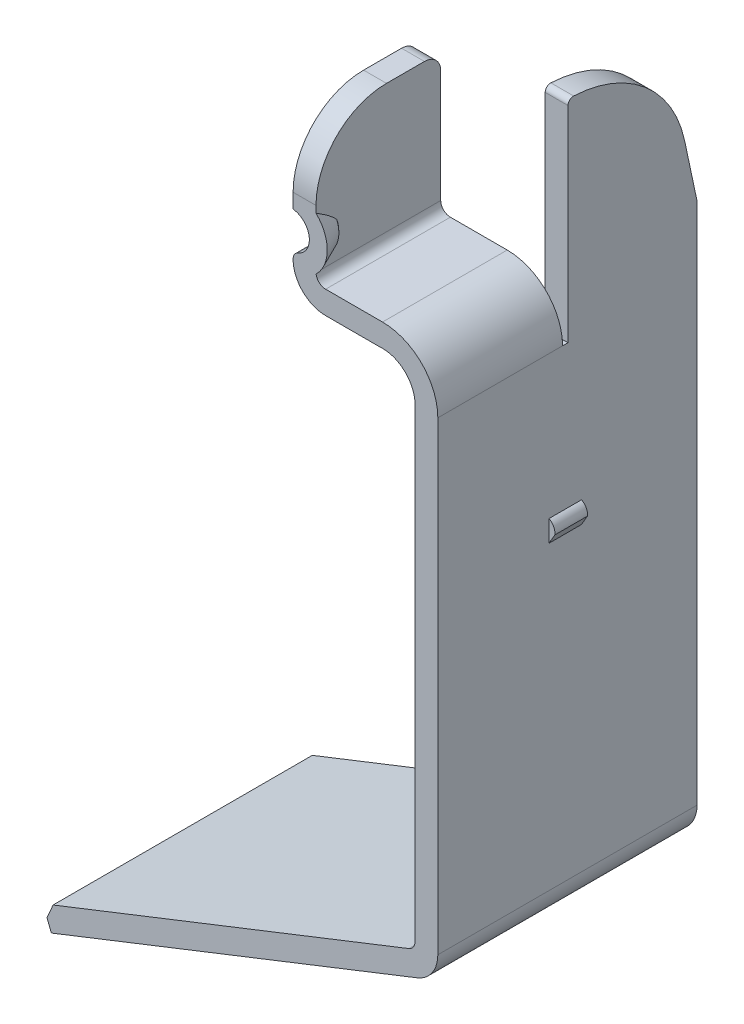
ISO-10303-21;
HEADER;
FILE_DESCRIPTION(('STEP AP214'),'2;1');
FILE_NAME('part.step','',(''),(''),'','','');
FILE_SCHEMA(('AUTOMOTIVE_DESIGN { 1 0 10303 214 1 1 1 1 }'));
ENDSEC;
DATA;
#1=APPLICATION_CONTEXT('core data for automotive mechanical design processes');
#2=APPLICATION_PROTOCOL_DEFINITION('international standard','automotive_design',2000,#1);
#3=PRODUCT_CONTEXT('',#1,'mechanical');
#4=PRODUCT('Part','Part','',(#3));
#5=PRODUCT_RELATED_PRODUCT_CATEGORY('part','',(#4));
#6=PRODUCT_DEFINITION_FORMATION('','',#4);
#7=PRODUCT_DEFINITION_CONTEXT('part definition',#1,'design');
#8=PRODUCT_DEFINITION('design','',#6,#7);
#9=PRODUCT_DEFINITION_SHAPE('','',#8);
#10=(LENGTH_UNIT() NAMED_UNIT(*) SI_UNIT(.MILLI.,.METRE.));
#11=(NAMED_UNIT(*) PLANE_ANGLE_UNIT() SI_UNIT($,.RADIAN.));
#12=(NAMED_UNIT(*) SI_UNIT($,.STERADIAN.) SOLID_ANGLE_UNIT());
#13=UNCERTAINTY_MEASURE_WITH_UNIT(LENGTH_MEASURE(1.E-05),#10,'distance_accuracy_value','');
#14=(GEOMETRIC_REPRESENTATION_CONTEXT(3) GLOBAL_UNCERTAINTY_ASSIGNED_CONTEXT((#13)) GLOBAL_UNIT_ASSIGNED_CONTEXT((#10,
#11,#12)) REPRESENTATION_CONTEXT('',''));
#15=CARTESIAN_POINT('',(0.,0.,0.));
#16=DIRECTION('',(0.,0.,1.));
#17=DIRECTION('',(1.,0.,0.));
#18=AXIS2_PLACEMENT_3D('',#15,#16,#17);
#19=CARTESIAN_POINT('',(12.3966122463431,32.9922720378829,-5.842));
#20=DIRECTION('',(1.,0.,0.));
#21=DIRECTION('',(0.,0.,-1.));
#22=AXIS2_PLACEMENT_3D('',#19,#20,#21);
#23=PLANE('',#22);
#24=CARTESIAN_POINT('',(12.3966122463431,34.6686720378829,-0.967492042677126));
#25=CARTESIAN_POINT('',(12.3966122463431,34.6984967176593,-0.940173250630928));
#26=CARTESIAN_POINT('',(12.3966122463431,34.7273615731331,-0.91185783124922));
#27=CARTESIAN_POINT('',(12.3966122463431,34.7834644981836,-0.853710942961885));
#28=CARTESIAN_POINT('',(12.3966122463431,34.8107042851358,-0.823881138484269));
#29=CARTESIAN_POINT('',(12.3966122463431,34.8638854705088,-0.763153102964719));
#30=CARTESIAN_POINT('',(12.3966122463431,34.889828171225,-0.732255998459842));
#31=CARTESIAN_POINT('',(12.3966122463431,34.940679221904,-0.669608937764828));
#32=CARTESIAN_POINT('',(12.3966122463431,34.9655872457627,-0.637858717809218));
#33=CARTESIAN_POINT('',(12.3966122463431,35.038999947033,-0.541677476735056));
#34=CARTESIAN_POINT('',(12.3966122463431,35.0862284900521,-0.476274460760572));
#35=CARTESIAN_POINT('',(12.3966122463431,35.1787869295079,-0.343091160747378));
#36=CARTESIAN_POINT('',(12.3966122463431,35.2240902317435,-0.275292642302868));
#37=CARTESIAN_POINT('',(12.3966122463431,35.2907056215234,-0.172687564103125));
#38=CARTESIAN_POINT('',(12.3966122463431,35.3126969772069,-0.138319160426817));
#39=CARTESIAN_POINT('',(12.3966122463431,35.3562798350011,-0.0693353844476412));
#40=CARTESIAN_POINT('',(12.3966122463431,35.3778713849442,-0.0347200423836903));
#41=CARTESIAN_POINT('',(12.3966122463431,35.3992927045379,0.));
#42=B_SPLINE_CURVE_WITH_KNOTS('',3,(#24,#25,#26,#27,#28,#29,#30,#31,#32,#33,#34,#35,#36,#37,#38,
#39,#40,#41),.UNSPECIFIED.,.F.,.F.,(4,2,2,2,2,2,2,2,4),(0.,0.121262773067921,0.24239503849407,
0.363403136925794,0.484449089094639,0.726378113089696,0.970967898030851,1.09337176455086,
1.21576089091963),.UNSPECIFIED.);
#43=CARTESIAN_POINT('',(12.3966122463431,34.6686720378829,-0.967492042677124));
#44=VERTEX_POINT('',#43);
#45=CARTESIAN_POINT('',(12.3966122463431,35.3992927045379,0.));
#46=VERTEX_POINT('',#45);
#47=EDGE_CURVE('E295',#44,#46,#42,.T.);
#48=ORIENTED_EDGE('',*,*,#47,.F.);
#49=CARTESIAN_POINT('',(12.3966122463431,34.6686720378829,-0.967492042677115));
#50=CARTESIAN_POINT('',(12.3966122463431,34.6333036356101,-0.980690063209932));
#51=CARTESIAN_POINT('',(12.3966122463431,34.5975342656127,-0.992897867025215));
#52=CARTESIAN_POINT('',(12.3966122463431,34.5251958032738,-1.01491583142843));
#53=CARTESIAN_POINT('',(12.3966122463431,34.4886253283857,-1.02472142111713));
#54=CARTESIAN_POINT('',(12.3966122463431,34.4160659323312,-1.04118215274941));
#55=CARTESIAN_POINT('',(12.3966122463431,34.3800990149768,-1.04793242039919));
#56=CARTESIAN_POINT('',(12.3966122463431,34.3077455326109,-1.0583970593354));
#57=CARTESIAN_POINT('',(12.3966122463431,34.2713592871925,-1.06211360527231));
#58=CARTESIAN_POINT('',(12.3966122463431,34.200643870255,-1.06616523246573));
#59=CARTESIAN_POINT('',(12.3966122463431,34.166325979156,-1.0666944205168));
#60=CARTESIAN_POINT('',(12.3966122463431,34.097772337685,-1.06486539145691));
#61=CARTESIAN_POINT('',(12.3966122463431,34.0635365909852,-1.06250704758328));
#62=CARTESIAN_POINT('',(12.3966122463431,33.9668938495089,-1.05188120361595));
#63=CARTESIAN_POINT('',(12.3966122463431,33.9048271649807,-1.04032431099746));
#64=CARTESIAN_POINT('',(12.3966122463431,33.8127387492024,-1.01717325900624));
#65=CARTESIAN_POINT('',(12.3966122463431,33.7819501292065,-1.00838515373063));
#66=CARTESIAN_POINT('',(12.3966122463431,33.7209374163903,-0.989130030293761));
#67=CARTESIAN_POINT('',(12.3966122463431,33.6907127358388,-0.978664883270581));
#68=CARTESIAN_POINT('',(12.3966122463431,33.6607502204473,-0.967492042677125));
#69=B_SPLINE_CURVE_WITH_KNOTS('',3,(#49,#50,#51,#52,#53,#54,#55,#56,#57,#58,#59,#60,#61,#62,#63,
#64,#65,#66,#67,#68),.UNSPECIFIED.,.F.,.F.,(4,2,2,2,2,2,2,2,2,4),(0.,0.113281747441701,
0.226777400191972,0.336444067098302,0.446032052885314,0.548872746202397,0.651717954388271,
0.840415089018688,0.93643527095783,1.03234905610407),.UNSPECIFIED.);
#70=CARTESIAN_POINT('',(12.3966122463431,33.6607502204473,-0.967492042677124));
#71=VERTEX_POINT('',#70);
#72=EDGE_CURVE('E347',#44,#71,#69,.T.);
#73=ORIENTED_EDGE('',*,*,#72,.T.);
#74=CARTESIAN_POINT('',(12.3966122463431,33.6607502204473,-0.967492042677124));
#75=CARTESIAN_POINT('',(12.3966122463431,33.6309255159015,-0.940173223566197));
#76=CARTESIAN_POINT('',(12.3966122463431,33.6020606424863,-0.911857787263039));
#77=CARTESIAN_POINT('',(12.3966122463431,33.5459577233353,-0.853710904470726));
#78=CARTESIAN_POINT('',(12.3966122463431,33.5187179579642,-0.823881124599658));
#79=CARTESIAN_POINT('',(12.3966122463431,33.4655367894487,-0.763153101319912));
#80=CARTESIAN_POINT('',(12.3966122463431,33.4395940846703,-0.732255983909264));
#81=CARTESIAN_POINT('',(12.3966122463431,33.3887430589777,-0.669608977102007));
#82=CARTESIAN_POINT('',(12.3966122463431,33.3638350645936,-0.637858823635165));
#83=CARTESIAN_POINT('',(12.3966122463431,33.2904222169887,-0.54167727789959));
#84=CARTESIAN_POINT('',(12.3966122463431,33.2431932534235,-0.476273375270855));
#85=CARTESIAN_POINT('',(12.3966122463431,33.1617935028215,-0.359147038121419));
#86=CARTESIAN_POINT('',(12.3966122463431,33.1271301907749,-0.307761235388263));
#87=CARTESIAN_POINT('',(12.3966122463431,33.0589251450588,-0.204210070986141));
#88=CARTESIAN_POINT('',(12.3966122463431,33.025384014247,-0.152044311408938));
#89=CARTESIAN_POINT('',(12.3966122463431,32.9922720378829,-0.0996119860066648));
#90=B_SPLINE_CURVE_WITH_KNOTS('',3,(#74,#75,#76,#77,#78,#79,#80,#81,#82,#83,#84,#85,#86,#87,#88,
#89),.UNSPECIFIED.,.F.,.F.,(4,2,2,2,2,2,2,4),(0.,0.121262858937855,0.242395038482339,
0.363403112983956,0.484449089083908,0.726378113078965,0.912318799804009,1.09835782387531),.UNSPECIFIED.);
#91=CARTESIAN_POINT('',(12.3966122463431,32.9922720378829,-0.0996119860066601));
#92=VERTEX_POINT('',#91);
#93=EDGE_CURVE('E326',#71,#92,#90,.T.);
#94=ORIENTED_EDGE('',*,*,#93,.T.);
#95=DIRECTION('',(0.,0.,1.));
#96=VECTOR('',#95,1.);
#97=CARTESIAN_POINT('',(12.3966122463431,32.9922720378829,-5.842));
#98=LINE('',#97,#96);
#99=CARTESIAN_POINT('',(12.3966122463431,32.9922720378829,-5.842));
#100=VERTEX_POINT('',#99);
#101=EDGE_CURVE('E480',#100,#92,#98,.T.);
#102=ORIENTED_EDGE('',*,*,#101,.F.);
#103=DIRECTION('',(0.,1.,0.));
#104=VECTOR('',#103,1.);
#105=CARTESIAN_POINT('',(12.3966122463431,32.9922720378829,-5.842));
#106=LINE('',#105,#104);
#107=CARTESIAN_POINT('',(12.3966122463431,38.2524,-5.842));
#108=VERTEX_POINT('',#107);
#109=EDGE_CURVE('E522',#100,#108,#106,.T.);
#110=ORIENTED_EDGE('',*,*,#109,.T.);
#111=CARTESIAN_POINT('',(12.3966122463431,38.2524,-5.08));
#112=DIRECTION('',(1.,0.,0.));
#113=DIRECTION('',(0.,0.,-1.));
#114=AXIS2_PLACEMENT_3D('',#111,#112,#113);
#115=CIRCLE('',#114,0.762);
#116=CARTESIAN_POINT('',(12.3966122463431,39.0144,-5.08));
#117=VERTEX_POINT('',#116);
#118=EDGE_CURVE('E362',#108,#117,#115,.T.);
#119=ORIENTED_EDGE('',*,*,#118,.T.);
#120=DIRECTION('',(0.,0.,-1.));
#121=VECTOR('',#120,1.);
#122=CARTESIAN_POINT('',(12.3966122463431,39.0144,-5.842));
#123=LINE('',#122,#121);
#124=CARTESIAN_POINT('',(12.3966122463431,39.0144,-3.302));
#125=VERTEX_POINT('',#124);
#126=EDGE_CURVE('E541',#125,#117,#123,.T.);
#127=ORIENTED_EDGE('',*,*,#126,.F.);
#128=CARTESIAN_POINT('',(12.3966122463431,35.7124,-3.302));
#129=DIRECTION('',(1.,0.,0.));
#130=DIRECTION('',(0.,0.,-1.));
#131=AXIS2_PLACEMENT_3D('',#128,#129,#130);
#132=CIRCLE('',#131,3.302);
#133=CARTESIAN_POINT('',(12.3966122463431,35.7124,0.));
#134=VERTEX_POINT('',#133);
#135=EDGE_CURVE('E367',#134,#125,#132,.F.);
#136=ORIENTED_EDGE('',*,*,#135,.F.);
#137=DIRECTION('',(0.,1.,0.));
#138=VECTOR('',#137,1.);
#139=CARTESIAN_POINT('',(12.3966122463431,32.9922720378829,0.));
#140=LINE('',#139,#138);
#141=EDGE_CURVE('E500',#46,#134,#140,.T.);
#142=ORIENTED_EDGE('',*,*,#141,.F.);
#143=EDGE_LOOP('',(#48,#73,#94,#102,#110,#119,#127,#136,#142));
#144=FACE_BOUND('',#143,.T.);
#145=ADVANCED_FACE('F32',(#144),#23,.T.);
#146=CARTESIAN_POINT('',(12.8477611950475,32.9922720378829,-5.842));
#147=DIRECTION('',(0.,0.,1.));
#148=DIRECTION('',(1.,0.,0.));
#149=AXIS2_PLACEMENT_3D('',#146,#147,#148);
#150=CYLINDRICAL_SURFACE('',#149,0.451148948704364);
#151=ORIENTED_EDGE('',*,*,#101,.T.);
#152=CARTESIAN_POINT('',(12.3966122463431,32.9922720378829,-0.0996119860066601));
#153=CARTESIAN_POINT('',(12.3966126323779,32.9871289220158,-0.0914621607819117));
#154=CARTESIAN_POINT('',(12.3967001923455,32.9820596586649,-0.0832663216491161));
#155=CARTESIAN_POINT('',(12.3970373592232,32.9720607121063,-0.0667984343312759));
#156=CARTESIAN_POINT('',(12.3972868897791,32.9671309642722,-0.0585264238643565));
#157=CARTESIAN_POINT('',(12.3979357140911,32.9573981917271,-0.0419144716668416));
#158=CARTESIAN_POINT('',(12.398335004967,32.9525951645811,-0.033574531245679));
#159=CARTESIAN_POINT('',(12.3992740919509,32.9431051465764,-0.0168314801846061));
#160=CARTESIAN_POINT('',(12.3998139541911,32.9384182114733,-0.0084283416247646));
#161=CARTESIAN_POINT('',(12.4004192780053,32.9337862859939,0.));
#162=B_SPLINE_CURVE_WITH_KNOTS('',3,(#152,#153,#154,#155,#156,#157,#158,#159,#160,#161),
.UNSPECIFIED.,.F.,.F.,(4,2,2,2,4),(0.,0.0289094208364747,0.057805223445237,0.0867004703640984,
0.115609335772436),.UNSPECIFIED.);
#163=CARTESIAN_POINT('',(12.4004192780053,32.9337862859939,0.));
#164=VERTEX_POINT('',#163);
#165=EDGE_CURVE('E353',#92,#164,#162,.T.);
#166=ORIENTED_EDGE('',*,*,#165,.T.);
#167=CARTESIAN_POINT('',(12.8477611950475,32.9922720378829,0.));
#168=DIRECTION('',(0.,0.,-1.));
#169=DIRECTION('',(-1.,0.,0.));
#170=AXIS2_PLACEMENT_3D('',#167,#168,#169);
#171=CIRCLE('',#170,0.451148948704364);
#172=CARTESIAN_POINT('',(12.8477611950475,32.5411230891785,0.));
#173=VERTEX_POINT('',#172);
#174=EDGE_CURVE('E502',#173,#164,#171,.T.);
#175=ORIENTED_EDGE('',*,*,#174,.F.);
#176=DIRECTION('',(0.,0.,1.));
#177=VECTOR('',#176,1.);
#178=CARTESIAN_POINT('',(12.8477611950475,32.5411230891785,-5.842));
#179=LINE('',#178,#177);
#180=CARTESIAN_POINT('',(12.8477611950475,32.5411230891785,-5.842));
#181=VERTEX_POINT('',#180);
#182=EDGE_CURVE('E478',#181,#173,#179,.T.);
#183=ORIENTED_EDGE('',*,*,#182,.F.);
#184=CARTESIAN_POINT('',(12.8477611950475,32.9922720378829,-5.842));
#185=DIRECTION('',(0.,0.,-1.));
#186=DIRECTION('',(-1.,0.,0.));
#187=AXIS2_PLACEMENT_3D('',#184,#185,#186);
#188=CIRCLE('',#187,0.451148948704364);
#189=EDGE_CURVE('E525',#181,#100,#188,.T.);
#190=ORIENTED_EDGE('',*,*,#189,.T.);
#191=EDGE_LOOP('',(#151,#166,#175,#183,#190));
#192=FACE_BOUND('',#191,.T.);
#193=ADVANCED_FACE('F339',(#192),#150,.F.);
#194=CARTESIAN_POINT('',(17.0357763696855,8.16844913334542,0.));
#195=DIRECTION('',(-1.,0.,0.));
#196=DIRECTION('',(0.,-1.,0.));
#197=AXIS2_PLACEMENT_3D('',#194,#195,#196);
#198=PLANE('',#197);
#199=DIRECTION('',(0.,1.,0.));
#200=VECTOR('',#199,1.);
#201=CARTESIAN_POINT('',(17.0357763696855,8.16844913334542,-6.096));
#202=LINE('',#201,#200);
#203=CARTESIAN_POINT('',(17.0357763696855,29.9503230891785,-6.096));
#204=VERTEX_POINT('',#203);
#205=CARTESIAN_POINT('',(17.0357763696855,39.5708720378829,-6.096));
#206=VERTEX_POINT('',#205);
#207=EDGE_CURVE('E458',#204,#206,#202,.T.);
#208=ORIENTED_EDGE('',*,*,#207,.T.);
#209=CARTESIAN_POINT('',(17.0357763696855,39.5708720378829,-6.35));
#210=DIRECTION('',(-1.,0.,0.));
#211=DIRECTION('',(0.,-1.,0.));
#212=AXIS2_PLACEMENT_3D('',#209,#210,#211);
#213=CIRCLE('',#212,0.254);
#214=CARTESIAN_POINT('',(17.0357763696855,39.8245838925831,-6.36209523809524));
#215=VERTEX_POINT('',#214);
#216=EDGE_CURVE('E382',#206,#215,#213,.T.);
#217=ORIENTED_EDGE('',*,*,#216,.T.);
#218=CARTESIAN_POINT('',(17.0357763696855,34.2429230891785,-6.096));
#219=DIRECTION('',(-1.,0.,0.));
#220=DIRECTION('',(0.,-1.,0.));
#221=AXIS2_PLACEMENT_3D('',#218,#219,#220);
#222=CIRCLE('',#221,5.588);
#223=CARTESIAN_POINT('',(17.0357763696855,35.4047336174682,-11.5618887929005));
#224=VERTEX_POINT('',#223);
#225=EDGE_CURVE('E442',#224,#215,#222,.F.);
#226=ORIENTED_EDGE('',*,*,#225,.F.);
#227=DIRECTION('',(0.,0.978147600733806,0.207911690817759));
#228=VECTOR('',#227,1.);
#229=CARTESIAN_POINT('',(17.0357763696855,11.6971213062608,-16.6010973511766));
#230=LINE('',#229,#228);
#231=CARTESIAN_POINT('',(17.0357763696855,32.6792886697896,-12.1412));
#232=VERTEX_POINT('',#231);
#233=EDGE_CURVE('E436',#232,#224,#230,.T.);
#234=ORIENTED_EDGE('',*,*,#233,.F.);
#235=DIRECTION('',(0.,1.,0.));
#236=VECTOR('',#235,1.);
#237=CARTESIAN_POINT('',(17.0357763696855,8.16844913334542,-12.1412));
#238=LINE('',#237,#236);
#239=CARTESIAN_POINT('',(17.0357763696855,8.16844913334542,-12.1412));
#240=VERTEX_POINT('',#239);
#241=EDGE_CURVE('E392',#240,#232,#238,.T.);
#242=ORIENTED_EDGE('',*,*,#241,.F.);
#243=DIRECTION('',(0.,0.,1.));
#244=VECTOR('',#243,1.);
#245=CARTESIAN_POINT('',(17.0357763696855,8.16844913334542,0.));
#246=LINE('',#245,#244);
#247=CARTESIAN_POINT('',(17.0357763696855,8.16844913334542,0.));
#248=VERTEX_POINT('',#247);
#249=EDGE_CURVE('E412',#240,#248,#246,.T.);
#250=ORIENTED_EDGE('',*,*,#249,.T.);
#251=DIRECTION('',(0.,1.,0.));
#252=VECTOR('',#251,1.);
#253=CARTESIAN_POINT('',(17.0357763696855,8.16844913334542,0.));
#254=LINE('',#253,#252);
#255=CARTESIAN_POINT('',(17.0357763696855,29.9503230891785,0.));
#256=VERTEX_POINT('',#255);
#257=EDGE_CURVE('E395',#248,#256,#254,.T.);
#258=ORIENTED_EDGE('',*,*,#257,.T.);
#259=DIRECTION('',(0.,0.,1.));
#260=VECTOR('',#259,1.);
#261=CARTESIAN_POINT('',(17.0357763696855,29.9503230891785,-5.842));
#262=LINE('',#261,#260);
#263=CARTESIAN_POINT('',(17.0357763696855,29.9503230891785,-5.842));
#264=VERTEX_POINT('',#263);
#265=EDGE_CURVE('E472',#264,#256,#262,.T.);
#266=ORIENTED_EDGE('',*,*,#265,.F.);
#267=DIRECTION('',(0.,0.,1.));
#268=VECTOR('',#267,1.);
#269=CARTESIAN_POINT('',(17.0357763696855,29.9503230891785,0.));
#270=LINE('',#269,#268);
#271=EDGE_CURVE('E455',#204,#264,#270,.T.);
#272=ORIENTED_EDGE('',*,*,#271,.F.);
#273=EDGE_LOOP('',(#208,#217,#226,#234,#242,#250,#258,#266,#272));
#274=FACE_BOUND('',#273,.T.);
#275=DIRECTION('',(0.,0.,1.));
#276=VECTOR('',#275,1.);
#277=CARTESIAN_POINT('',(17.0357763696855,22.2592097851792,-7.493));
#278=LINE('',#277,#276);
#279=CARTESIAN_POINT('',(17.0357763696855,22.2592097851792,-7.493));
#280=VERTEX_POINT('',#279);
#281=CARTESIAN_POINT('',(17.0357763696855,22.2592097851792,-5.969));
#282=VERTEX_POINT('',#281);
#283=EDGE_CURVE('E567',#280,#282,#278,.T.);
#284=ORIENTED_EDGE('',*,*,#283,.F.);
#285=DIRECTION('',(0.,-1.,0.));
#286=VECTOR('',#285,1.);
#287=CARTESIAN_POINT('',(17.0357763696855,21.3134430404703,-7.493));
#288=LINE('',#287,#286);
#289=CARTESIAN_POINT('',(17.0357763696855,23.2602423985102,-7.493));
#290=VERTEX_POINT('',#289);
#291=EDGE_CURVE('E576',#290,#280,#288,.T.);
#292=ORIENTED_EDGE('',*,*,#291,.F.);
#293=DIRECTION('',(0.,0.,1.));
#294=VECTOR('',#293,1.);
#295=CARTESIAN_POINT('',(17.0357763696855,23.2602423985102,-7.493));
#296=LINE('',#295,#294);
#297=CARTESIAN_POINT('',(17.0357763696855,23.2602423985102,-5.969));
#298=VERTEX_POINT('',#297);
#299=EDGE_CURVE('E575',#290,#298,#296,.T.);
#300=ORIENTED_EDGE('',*,*,#299,.T.);
#301=DIRECTION('',(0.,-1.,0.));
#302=VECTOR('',#301,1.);
#303=CARTESIAN_POINT('',(17.0357763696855,21.3134430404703,-5.969));
#304=LINE('',#303,#302);
#305=EDGE_CURVE('E581',#298,#282,#304,.T.);
#306=ORIENTED_EDGE('',*,*,#305,.T.);
#307=EDGE_LOOP('',(#284,#292,#300,#306));
#308=FACE_BOUND('',#307,.T.);
#309=ADVANCED_FACE('F604',(#274,#308),#198,.T.);
#310=CARTESIAN_POINT('',(15.5625763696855,29.9503230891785,-32.588188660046));
#311=DIRECTION('',(0.,-1.,0.));
#312=DIRECTION('',(1.,0.,0.));
#313=AXIS2_PLACEMENT_3D('',#310,#311,#312);
#314=PLANE('',#313);
#315=DIRECTION('',(1.,0.,0.));
#316=VECTOR('',#315,1.);
#317=CARTESIAN_POINT('',(17.0357763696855,29.9503230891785,-5.842));
#318=LINE('',#317,#316);
#319=CARTESIAN_POINT('',(18.1025763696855,29.9503230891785,-5.842));
#320=VERTEX_POINT('',#319);
#321=EDGE_CURVE('E534',#264,#320,#318,.T.);
#322=ORIENTED_EDGE('',*,*,#321,.T.);
#323=DIRECTION('',(0.,0.,-1.));
#324=VECTOR('',#323,1.);
#325=CARTESIAN_POINT('',(18.1025763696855,29.9503230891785,-32.588188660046));
#326=LINE('',#325,#324);
#327=CARTESIAN_POINT('',(18.1025763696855,29.9503230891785,-6.096));
#328=VERTEX_POINT('',#327);
#329=EDGE_CURVE('E469',#320,#328,#326,.T.);
#330=ORIENTED_EDGE('',*,*,#329,.T.);
#331=DIRECTION('',(1.,0.,0.));
#332=VECTOR('',#331,1.);
#333=CARTESIAN_POINT('',(15.5625763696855,29.9503230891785,-6.096));
#334=LINE('',#333,#332);
#335=EDGE_CURVE('E465',#204,#328,#334,.T.);
#336=ORIENTED_EDGE('',*,*,#335,.F.);
#337=ORIENTED_EDGE('',*,*,#271,.T.);
#338=EDGE_LOOP('',(#322,#330,#336,#337));
#339=FACE_BOUND('',#338,.T.);
#340=ADVANCED_FACE('F734',(#339),#314,.F.);
#341=CARTESIAN_POINT('',(18.1025763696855,8.16844913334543,0.));
#342=DIRECTION('',(1.,0.,0.));
#343=DIRECTION('',(0.,1.,0.));
#344=AXIS2_PLACEMENT_3D('',#341,#342,#343);
#345=PLANE('',#344);
#346=DIRECTION('',(0.,-1.,0.));
#347=VECTOR('',#346,1.);
#348=CARTESIAN_POINT('',(18.1025763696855,23.2602423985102,-5.207));
#349=LINE('',#348,#347);
#350=CARTESIAN_POINT('',(18.1025763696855,23.2602423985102,-5.207));
#351=VERTEX_POINT('',#350);
#352=CARTESIAN_POINT('',(18.1025763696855,22.2592097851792,-5.207));
#353=VERTEX_POINT('',#352);
#354=EDGE_CURVE('E561',#351,#353,#349,.T.);
#355=ORIENTED_EDGE('',*,*,#354,.F.);
#356=DIRECTION('',(0.,0.,-1.));
#357=VECTOR('',#356,1.);
#358=CARTESIAN_POINT('',(18.1025763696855,23.2602423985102,-5.207));
#359=LINE('',#358,#357);
#360=CARTESIAN_POINT('',(18.1025763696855,23.2602423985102,-6.731));
#361=VERTEX_POINT('',#360);
#362=EDGE_CURVE('E555',#351,#361,#359,.T.);
#363=ORIENTED_EDGE('',*,*,#362,.T.);
#364=DIRECTION('',(0.,-1.,0.));
#365=VECTOR('',#364,1.);
#366=CARTESIAN_POINT('',(18.1025763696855,23.2602423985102,-6.731));
#367=LINE('',#366,#365);
#368=CARTESIAN_POINT('',(18.1025763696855,22.2592097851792,-6.731));
#369=VERTEX_POINT('',#368);
#370=EDGE_CURVE('E564',#361,#369,#367,.T.);
#371=ORIENTED_EDGE('',*,*,#370,.T.);
#372=DIRECTION('',(0.,0.,-1.));
#373=VECTOR('',#372,1.);
#374=CARTESIAN_POINT('',(18.1025763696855,22.2592097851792,-5.207));
#375=LINE('',#374,#373);
#376=EDGE_CURVE('E548',#353,#369,#375,.T.);
#377=ORIENTED_EDGE('',*,*,#376,.F.);
#378=EDGE_LOOP('',(#355,#363,#371,#377));
#379=FACE_BOUND('',#378,.T.);
#380=CARTESIAN_POINT('',(18.1025763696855,34.2429230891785,-6.096));
#381=DIRECTION('',(1.,0.,0.));
#382=DIRECTION('',(0.,1.,0.));
#383=AXIS2_PLACEMENT_3D('',#380,#381,#382);
#384=CIRCLE('',#383,5.588);
#385=CARTESIAN_POINT('',(18.1025763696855,39.8245838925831,-6.36209523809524));
#386=VERTEX_POINT('',#385);
#387=CARTESIAN_POINT('',(18.1025763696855,35.4047336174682,-11.5618887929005));
#388=VERTEX_POINT('',#387);
#389=EDGE_CURVE('E453',#386,#388,#384,.F.);
#390=ORIENTED_EDGE('',*,*,#389,.F.);
#391=CARTESIAN_POINT('',(18.1025763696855,39.5708720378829,-6.35));
#392=DIRECTION('',(1.,0.,0.));
#393=DIRECTION('',(0.,1.,0.));
#394=AXIS2_PLACEMENT_3D('',#391,#392,#393);
#395=CIRCLE('',#394,0.254);
#396=CARTESIAN_POINT('',(18.1025763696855,39.5708720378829,-6.096));
#397=VERTEX_POINT('',#396);
#398=EDGE_CURVE('E378',#386,#397,#395,.T.);
#399=ORIENTED_EDGE('',*,*,#398,.T.);
#400=DIRECTION('',(0.,-1.,0.));
#401=VECTOR('',#400,1.);
#402=CARTESIAN_POINT('',(18.1025763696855,23.999686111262,-6.096));
#403=LINE('',#402,#401);
#404=EDGE_CURVE('E462',#397,#328,#403,.T.);
#405=ORIENTED_EDGE('',*,*,#404,.T.);
#406=ORIENTED_EDGE('',*,*,#329,.F.);
#407=CARTESIAN_POINT('',(18.1025763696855,29.9503230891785,0.));
#408=VERTEX_POINT('',#407);
#409=EDGE_CURVE('E461',#408,#320,#326,.T.);
#410=ORIENTED_EDGE('',*,*,#409,.F.);
#411=DIRECTION('',(0.,1.,0.));
#412=VECTOR('',#411,1.);
#413=CARTESIAN_POINT('',(18.1025763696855,8.16844913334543,0.));
#414=LINE('',#413,#412);
#415=CARTESIAN_POINT('',(18.1025763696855,8.16844913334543,0.));
#416=VERTEX_POINT('',#415);
#417=EDGE_CURVE('E387',#416,#408,#414,.T.);
#418=ORIENTED_EDGE('',*,*,#417,.F.);
#419=DIRECTION('',(0.,0.,-1.));
#420=VECTOR('',#419,1.);
#421=CARTESIAN_POINT('',(18.1025763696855,8.16844913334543,0.));
#422=LINE('',#421,#420);
#423=CARTESIAN_POINT('',(18.1025763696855,8.16844913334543,-12.1412));
#424=VERTEX_POINT('',#423);
#425=EDGE_CURVE('E409',#416,#424,#422,.T.);
#426=ORIENTED_EDGE('',*,*,#425,.T.);
#427=DIRECTION('',(0.,1.,0.));
#428=VECTOR('',#427,1.);
#429=CARTESIAN_POINT('',(18.1025763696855,8.16844913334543,-12.1412));
#430=LINE('',#429,#428);
#431=CARTESIAN_POINT('',(18.1025763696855,32.6792886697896,-12.1412));
#432=VERTEX_POINT('',#431);
#433=EDGE_CURVE('E389',#424,#432,#430,.T.);
#434=ORIENTED_EDGE('',*,*,#433,.T.);
#435=DIRECTION('',(0.,-0.978147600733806,-0.207911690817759));
#436=VECTOR('',#435,1.);
#437=CARTESIAN_POINT('',(18.1025763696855,20.2166118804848,-14.7902237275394));
#438=LINE('',#437,#436);
#439=EDGE_CURVE('E449',#388,#432,#438,.T.);
#440=ORIENTED_EDGE('',*,*,#439,.F.);
#441=EDGE_LOOP('',(#390,#399,#405,#406,#410,#418,#426,#434,#440));
#442=FACE_BOUND('',#441,.T.);
#443=ADVANCED_FACE('F703',(#379,#442),#345,.T.);
#444=CARTESIAN_POINT('',(16.5785763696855,8.16844913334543,0.));
#445=DIRECTION('',(0.,0.,1.));
#446=DIRECTION('',(1.,0.,0.));
#447=AXIS2_PLACEMENT_3D('',#444,#445,#446);
#448=CYLINDRICAL_SURFACE('',#447,1.524);
#449=DIRECTION('',(0.,0.,-1.));
#450=VECTOR('',#449,1.);
#451=CARTESIAN_POINT('',(17.1371242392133,6.75049275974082,0.));
#452=LINE('',#451,#450);
#453=CARTESIAN_POINT('',(17.1371242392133,6.75049275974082,0.));
#454=VERTEX_POINT('',#453);
#455=CARTESIAN_POINT('',(17.1371242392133,6.75049275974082,-12.1412));
#456=VERTEX_POINT('',#455);
#457=EDGE_CURVE('E431',#454,#456,#452,.T.);
#458=ORIENTED_EDGE('',*,*,#457,.T.);
#459=CARTESIAN_POINT('',(16.5785763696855,8.16844913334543,-12.1412));
#460=DIRECTION('',(0.,0.,1.));
#461=DIRECTION('',(1.,0.,0.));
#462=AXIS2_PLACEMENT_3D('',#459,#460,#461);
#463=CIRCLE('',#462,1.524);
#464=EDGE_CURVE('E400',#456,#424,#463,.T.);
#465=ORIENTED_EDGE('',*,*,#464,.T.);
#466=ORIENTED_EDGE('',*,*,#425,.F.);
#467=CARTESIAN_POINT('',(16.5785763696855,8.16844913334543,0.));
#468=DIRECTION('',(0.,0.,1.));
#469=DIRECTION('',(1.,0.,0.));
#470=AXIS2_PLACEMENT_3D('',#467,#468,#469);
#471=CIRCLE('',#470,1.524);
#472=EDGE_CURVE('E397',#454,#416,#471,.T.);
#473=ORIENTED_EDGE('',*,*,#472,.F.);
#474=EDGE_LOOP('',(#458,#465,#466,#473));
#475=FACE_BOUND('',#474,.T.);
#476=ADVANCED_FACE('F700',(#475),#448,.T.);
#477=CARTESIAN_POINT('',(16.5785763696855,8.16844913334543,0.));
#478=DIRECTION('',(0.,0.,1.));
#479=DIRECTION('',(1.,0.,0.));
#480=AXIS2_PLACEMENT_3D('',#477,#478,#479);
#481=CYLINDRICAL_SURFACE('',#480,0.457199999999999);
#482=DIRECTION('',(0.,0.,1.));
#483=VECTOR('',#482,1.);
#484=CARTESIAN_POINT('',(16.7461407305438,7.74306222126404,0.));
#485=LINE('',#484,#483);
#486=CARTESIAN_POINT('',(16.7461407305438,7.74306222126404,-12.1412));
#487=VERTEX_POINT('',#486);
#488=CARTESIAN_POINT('',(16.7461407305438,7.74306222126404,0.));
#489=VERTEX_POINT('',#488);
#490=EDGE_CURVE('E427',#487,#489,#485,.T.);
#491=ORIENTED_EDGE('',*,*,#490,.T.);
#492=CARTESIAN_POINT('',(16.5785763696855,8.16844913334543,0.));
#493=DIRECTION('',(0.,0.,1.));
#494=DIRECTION('',(1.,0.,0.));
#495=AXIS2_PLACEMENT_3D('',#492,#493,#494);
#496=CIRCLE('',#495,0.457199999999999);
#497=EDGE_CURVE('E406',#489,#248,#496,.T.);
#498=ORIENTED_EDGE('',*,*,#497,.T.);
#499=ORIENTED_EDGE('',*,*,#249,.F.);
#500=CARTESIAN_POINT('',(16.5785763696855,8.16844913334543,-12.1412));
#501=DIRECTION('',(0.,0.,1.));
#502=DIRECTION('',(1.,0.,0.));
#503=AXIS2_PLACEMENT_3D('',#500,#501,#502);
#504=CIRCLE('',#503,0.457199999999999);
#505=EDGE_CURVE('E403',#487,#240,#504,.T.);
#506=ORIENTED_EDGE('',*,*,#505,.F.);
#507=EDGE_LOOP('',(#491,#498,#499,#506));
#508=FACE_BOUND('',#507,.T.);
#509=ADVANCED_FACE('F674',(#508),#481,.F.);
#510=CARTESIAN_POINT('',(17.1371242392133,6.75049275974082,0.));
#511=DIRECTION('',(0.,0.,-1.));
#512=DIRECTION('',(-1.,0.,0.));
#513=AXIS2_PLACEMENT_3D('',#510,#511,#512);
#514=PLANE('',#513);
#515=CARTESIAN_POINT('',(11.7126591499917,33.0077670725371,0.));
#516=DIRECTION('',(0.,0.,-1.));
#517=DIRECTION('',(1.,0.,0.));
#518=AXIS2_PLACEMENT_3D('',#515,#516,#517);
#519=CIRCLE('',#518,0.388792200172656);
#520=CARTESIAN_POINT('',(11.3239031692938,33.0130738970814,0.));
#521=VERTEX_POINT('',#520);
#522=CARTESIAN_POINT('',(11.5588821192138,33.3648552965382,0.));
#523=VERTEX_POINT('',#522);
#524=EDGE_CURVE('E271',#521,#523,#519,.T.);
#525=ORIENTED_EDGE('',*,*,#524,.F.);
#526=DIRECTION('',(0.0880242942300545,0.996118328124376,0.));
#527=VECTOR('',#526,1.);
#528=CARTESIAN_POINT('',(11.2834928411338,32.5557743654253,0.));
#529=LINE('',#528,#527);
#530=CARTESIAN_POINT('',(11.3237611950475,33.0114672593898,0.));
#531=VERTEX_POINT('',#530);
#532=EDGE_CURVE('E285',#531,#521,#529,.T.);
#533=ORIENTED_EDGE('',*,*,#532,.F.);
#534=DIRECTION('',(0.,-1.,0.));
#535=VECTOR('',#534,1.);
#536=CARTESIAN_POINT('',(11.3237611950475,32.9922720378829,0.));
#537=LINE('',#536,#535);
#538=CARTESIAN_POINT('',(11.3237611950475,32.9922720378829,0.));
#539=VERTEX_POINT('',#538);
#540=EDGE_CURVE('E499',#531,#539,#537,.T.);
#541=ORIENTED_EDGE('',*,*,#540,.T.);
#542=CARTESIAN_POINT('',(12.8477611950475,32.9922720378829,0.));
#543=DIRECTION('',(0.,0.,1.));
#544=DIRECTION('',(-1.,0.,0.));
#545=AXIS2_PLACEMENT_3D('',#542,#543,#544);
#546=CIRCLE('',#545,1.524);
#547=CARTESIAN_POINT('',(12.8477611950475,31.4682720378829,0.));
#548=VERTEX_POINT('',#547);
#549=EDGE_CURVE('E493',#539,#548,#546,.T.);
#550=ORIENTED_EDGE('',*,*,#549,.T.);
#551=DIRECTION('',(1.,0.,0.));
#552=VECTOR('',#551,1.);
#553=CARTESIAN_POINT('',(15.3761040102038,31.4682720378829,0.));
#554=LINE('',#553,#552);
#555=CARTESIAN_POINT('',(15.3761040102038,31.4682720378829,0.));
#556=VERTEX_POINT('',#555);
#557=EDGE_CURVE('E489',#548,#556,#554,.T.);
#558=ORIENTED_EDGE('',*,*,#557,.T.);
#559=CARTESIAN_POINT('',(15.5117763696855,29.9503230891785,0.));
#560=DIRECTION('',(0.,0.,-1.));
#561=DIRECTION('',(1.,0.,0.));
#562=AXIS2_PLACEMENT_3D('',#559,#560,#561);
#563=CIRCLE('',#562,1.524);
#564=EDGE_CURVE('E511',#556,#256,#563,.T.);
#565=ORIENTED_EDGE('',*,*,#564,.T.);
#566=ORIENTED_EDGE('',*,*,#257,.F.);
#567=ORIENTED_EDGE('',*,*,#497,.F.);
#568=DIRECTION('',(-0.930417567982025,-0.366501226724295,0.));
#569=VECTOR('',#568,1.);
#570=CARTESIAN_POINT('',(16.7461407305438,7.74306222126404,0.));
#571=LINE('',#570,#569);
#572=CARTESIAN_POINT('',(0.0816686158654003,1.17875208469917,0.));
#573=VERTEX_POINT('',#572);
#574=EDGE_CURVE('E424',#489,#573,#571,.T.);
#575=ORIENTED_EDGE('',*,*,#574,.T.);
#576=DIRECTION('',(-0.39874906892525,-0.917060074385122,0.));
#577=VECTOR('',#576,1.);
#578=CARTESIAN_POINT('',(0.0816686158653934,1.17875208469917,0.));
#579=LINE('',#578,#577);
#580=CARTESIAN_POINT('',(-0.204800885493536,0.519917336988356,0.));
#581=VERTEX_POINT('',#580);
#582=EDGE_CURVE('E373',#573,#581,#579,.T.);
#583=ORIENTED_EDGE('',*,*,#582,.T.);
#584=DIRECTION('',(0.366501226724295,-0.930417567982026,0.));
#585=VECTOR('',#584,1.);
#586=CARTESIAN_POINT('',(0.,0.,0.));
#587=LINE('',#586,#585);
#588=CARTESIAN_POINT('',(0.,0.,0.));
#589=VERTEX_POINT('',#588);
#590=EDGE_CURVE('E434',#581,#589,#587,.T.);
#591=ORIENTED_EDGE('',*,*,#590,.T.);
#592=DIRECTION('',(-0.930417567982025,-0.366501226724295,0.));
#593=VECTOR('',#592,1.);
#594=CARTESIAN_POINT('',(17.1371242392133,6.75049275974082,0.));
#595=LINE('',#594,#593);
#596=EDGE_CURVE('E415',#454,#589,#595,.T.);
#597=ORIENTED_EDGE('',*,*,#596,.F.);
#598=ORIENTED_EDGE('',*,*,#472,.T.);
#599=ORIENTED_EDGE('',*,*,#417,.T.);
#600=CARTESIAN_POINT('',(15.5117763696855,29.9503230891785,0.));
#601=DIRECTION('',(0.,0.,1.));
#602=DIRECTION('',(1.,0.,0.));
#603=AXIS2_PLACEMENT_3D('',#600,#601,#602);
#604=CIRCLE('',#603,2.5908);
#605=CARTESIAN_POINT('',(15.5117763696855,32.5411230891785,0.));
#606=VERTEX_POINT('',#605);
#607=EDGE_CURVE('E508',#408,#606,#604,.T.);
#608=ORIENTED_EDGE('',*,*,#607,.T.);
#609=DIRECTION('',(-1.,0.,0.));
#610=VECTOR('',#609,1.);
#611=CARTESIAN_POINT('',(15.5117763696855,32.5411230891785,0.));
#612=LINE('',#611,#610);
#613=EDGE_CURVE('E505',#606,#173,#612,.T.);
#614=ORIENTED_EDGE('',*,*,#613,.T.);
#615=ORIENTED_EDGE('',*,*,#174,.T.);
#616=CARTESIAN_POINT('',(11.2144309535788,34.1647111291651,0.));
#617=DIRECTION('',(0.,0.,1.));
#618=DIRECTION('',(1.,0.,0.));
#619=AXIS2_PLACEMENT_3D('',#616,#617,#618);
#620=CIRCLE('',#619,1.70931105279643);
#621=EDGE_CURVE('E54',#164,#46,#620,.T.);
#622=ORIENTED_EDGE('',*,*,#621,.T.);
#623=ORIENTED_EDGE('',*,*,#141,.T.);
#624=DIRECTION('',(1.,0.,0.));
#625=VECTOR('',#624,1.);
#626=CARTESIAN_POINT('',(-0.204800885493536,35.7124,0.));
#627=LINE('',#626,#625);
#628=CARTESIAN_POINT('',(11.3237611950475,35.7124,0.));
#629=VERTEX_POINT('',#628);
#630=EDGE_CURVE('E545',#629,#134,#627,.T.);
#631=ORIENTED_EDGE('',*,*,#630,.F.);
#632=CARTESIAN_POINT('',(11.3237611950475,35.0286919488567,0.));
#633=VERTEX_POINT('',#632);
#634=EDGE_CURVE('E496',#629,#633,#537,.T.);
#635=ORIENTED_EDGE('',*,*,#634,.T.);
#636=CARTESIAN_POINT('',(11.2144309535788,34.1647111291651,0.));
#637=DIRECTION('',(0.,0.,1.));
#638=DIRECTION('',(1.,0.,0.));
#639=AXIS2_PLACEMENT_3D('',#636,#637,#638);
#640=CIRCLE('',#639,0.870870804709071);
#641=EDGE_CURVE('E287',#523,#633,#640,.T.);
#642=ORIENTED_EDGE('',*,*,#641,.F.);
#643=EDGE_LOOP('',(#525,#533,#541,#550,#558,#565,#566,#567,#575,#583,#591,#597,#598,#599,#608,
#614,#615,#622,#623,#631,#635,#642));
#644=FACE_BOUND('',#643,.T.);
#645=ADVANCED_FACE('F663',(#644),#514,.F.);
#646=CARTESIAN_POINT('',(17.1371242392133,6.75049275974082,0.));
#647=DIRECTION('',(-0.366501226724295,0.930417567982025,0.));
#648=DIRECTION('',(-0.930417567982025,-0.366501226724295,0.));
#649=AXIS2_PLACEMENT_3D('',#646,#647,#648);
#650=PLANE('',#649);
#651=DIRECTION('',(0.,0.,-1.));
#652=VECTOR('',#651,1.);
#653=CARTESIAN_POINT('',(0.,0.,0.));
#654=LINE('',#653,#652);
#655=CARTESIAN_POINT('',(0.,0.,-12.1412));
#656=VERTEX_POINT('',#655);
#657=EDGE_CURVE('E432',#589,#656,#654,.T.);
#658=ORIENTED_EDGE('',*,*,#657,.T.);
#659=DIRECTION('',(-0.930417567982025,-0.366501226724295,0.));
#660=VECTOR('',#659,1.);
#661=CARTESIAN_POINT('',(17.1371242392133,6.75049275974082,-12.1412));
#662=LINE('',#661,#660);
#663=EDGE_CURVE('E418',#456,#656,#662,.T.);
#664=ORIENTED_EDGE('',*,*,#663,.F.);
#665=ORIENTED_EDGE('',*,*,#457,.F.);
#666=ORIENTED_EDGE('',*,*,#596,.T.);
#667=EDGE_LOOP('',(#658,#664,#665,#666));
#668=FACE_BOUND('',#667,.T.);
#669=ADVANCED_FACE('F696',(#668),#650,.F.);
#670=CARTESIAN_POINT('',(17.1371242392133,6.75049275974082,-12.1412));
#671=DIRECTION('',(0.,0.,1.));
#672=DIRECTION('',(1.,0.,0.));
#673=AXIS2_PLACEMENT_3D('',#670,#671,#672);
#674=PLANE('',#673);
#675=DIRECTION('',(-0.366501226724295,0.930417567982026,0.));
#676=VECTOR('',#675,1.);
#677=CARTESIAN_POINT('',(0.,0.,-12.1412));
#678=LINE('',#677,#676);
#679=CARTESIAN_POINT('',(-0.204800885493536,0.519917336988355,-12.1412));
#680=VERTEX_POINT('',#679);
#681=EDGE_CURVE('E428',#656,#680,#678,.T.);
#682=ORIENTED_EDGE('',*,*,#681,.T.);
#683=DIRECTION('',(0.39874906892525,0.917060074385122,0.));
#684=VECTOR('',#683,1.);
#685=CARTESIAN_POINT('',(0.0816686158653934,1.17875208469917,-12.1412));
#686=LINE('',#685,#684);
#687=CARTESIAN_POINT('',(0.0816686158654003,1.17875208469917,-12.1412));
#688=VERTEX_POINT('',#687);
#689=EDGE_CURVE('E369',#680,#688,#686,.T.);
#690=ORIENTED_EDGE('',*,*,#689,.T.);
#691=DIRECTION('',(-0.930417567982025,-0.366501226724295,0.));
#692=VECTOR('',#691,1.);
#693=CARTESIAN_POINT('',(16.7461407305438,7.74306222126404,-12.1412));
#694=LINE('',#693,#692);
#695=EDGE_CURVE('E421',#487,#688,#694,.T.);
#696=ORIENTED_EDGE('',*,*,#695,.F.);
#697=ORIENTED_EDGE('',*,*,#505,.T.);
#698=ORIENTED_EDGE('',*,*,#241,.T.);
#699=DIRECTION('',(1.,0.,0.));
#700=VECTOR('',#699,1.);
#701=CARTESIAN_POINT('',(15.5625763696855,32.6792886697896,-12.1412));
#702=LINE('',#701,#700);
#703=EDGE_CURVE('E445',#232,#432,#702,.T.);
#704=ORIENTED_EDGE('',*,*,#703,.T.);
#705=ORIENTED_EDGE('',*,*,#433,.F.);
#706=ORIENTED_EDGE('',*,*,#464,.F.);
#707=ORIENTED_EDGE('',*,*,#663,.T.);
#708=EDGE_LOOP('',(#682,#690,#696,#697,#698,#704,#705,#706,#707));
#709=FACE_BOUND('',#708,.T.);
#710=ADVANCED_FACE('F692',(#709),#674,.F.);
#711=CARTESIAN_POINT('',(16.7461407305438,7.74306222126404,0.));
#712=DIRECTION('',(0.366501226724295,-0.930417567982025,0.));
#713=DIRECTION('',(0.930417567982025,0.366501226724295,0.));
#714=AXIS2_PLACEMENT_3D('',#711,#712,#713);
#715=PLANE('',#714);
#716=ORIENTED_EDGE('',*,*,#695,.T.);
#717=DIRECTION('',(0.,0.,1.));
#718=VECTOR('',#717,1.);
#719=CARTESIAN_POINT('',(0.0816686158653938,1.17875208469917,0.));
#720=LINE('',#719,#718);
#721=EDGE_CURVE('E375',#688,#573,#720,.T.);
#722=ORIENTED_EDGE('',*,*,#721,.T.);
#723=ORIENTED_EDGE('',*,*,#574,.F.);
#724=ORIENTED_EDGE('',*,*,#490,.F.);
#725=EDGE_LOOP('',(#716,#722,#723,#724));
#726=FACE_BOUND('',#725,.T.);
#727=ADVANCED_FACE('F679',(#726),#715,.F.);
#728=CARTESIAN_POINT('',(-0.390983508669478,0.992569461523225,0.));
#729=DIRECTION('',(-0.930417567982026,-0.366501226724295,0.));
#730=DIRECTION('',(0.366501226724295,-0.930417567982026,0.));
#731=AXIS2_PLACEMENT_3D('',#728,#729,#730);
#732=PLANE('',#731);
#733=ORIENTED_EDGE('',*,*,#590,.F.);
#734=DIRECTION('',(0.,0.,-1.));
#735=VECTOR('',#734,1.);
#736=CARTESIAN_POINT('',(-0.204800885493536,0.519917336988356,-12.1412));
#737=LINE('',#736,#735);
#738=EDGE_CURVE('E371',#581,#680,#737,.T.);
#739=ORIENTED_EDGE('',*,*,#738,.T.);
#740=ORIENTED_EDGE('',*,*,#681,.F.);
#741=ORIENTED_EDGE('',*,*,#657,.F.);
#742=EDGE_LOOP('',(#733,#739,#740,#741));
#743=FACE_BOUND('',#742,.T.);
#744=ADVANCED_FACE('F687',(#743),#732,.T.);
#745=CARTESIAN_POINT('',(15.5625763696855,20.2166118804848,-14.7902237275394));
#746=DIRECTION('',(0.,-0.207911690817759,0.978147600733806));
#747=DIRECTION('',(0.,-0.978147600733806,-0.207911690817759));
#748=AXIS2_PLACEMENT_3D('',#745,#746,#747);
#749=PLANE('',#748);
#750=ORIENTED_EDGE('',*,*,#233,.T.);
#751=DIRECTION('',(1.,0.,0.));
#752=VECTOR('',#751,1.);
#753=CARTESIAN_POINT('',(15.5625763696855,35.4047336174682,-11.5618887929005));
#754=LINE('',#753,#752);
#755=EDGE_CURVE('E446',#224,#388,#754,.T.);
#756=ORIENTED_EDGE('',*,*,#755,.T.);
#757=ORIENTED_EDGE('',*,*,#439,.T.);
#758=ORIENTED_EDGE('',*,*,#703,.F.);
#759=EDGE_LOOP('',(#750,#756,#757,#758));
#760=FACE_BOUND('',#759,.T.);
#761=ADVANCED_FACE('F750',(#760),#749,.F.);
#762=CARTESIAN_POINT('',(15.5625763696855,34.2429230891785,-6.096));
#763=DIRECTION('',(1.,0.,0.));
#764=DIRECTION('',(0.,1.,0.));
#765=AXIS2_PLACEMENT_3D('',#762,#763,#764);
#766=CYLINDRICAL_SURFACE('',#765,5.588);
#767=ORIENTED_EDGE('',*,*,#225,.T.);
#768=DIRECTION('',(1.,0.,0.));
#769=VECTOR('',#768,1.);
#770=CARTESIAN_POINT('',(15.5625763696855,39.8245838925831,-6.36209523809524));
#771=LINE('',#770,#769);
#772=EDGE_CURVE('E380',#215,#386,#771,.T.);
#773=ORIENTED_EDGE('',*,*,#772,.T.);
#774=ORIENTED_EDGE('',*,*,#389,.T.);
#775=ORIENTED_EDGE('',*,*,#755,.F.);
#776=EDGE_LOOP('',(#767,#773,#774,#775));
#777=FACE_BOUND('',#776,.T.);
#778=ADVANCED_FACE('F747',(#777),#766,.T.);
#779=CARTESIAN_POINT('',(15.5625763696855,23.999686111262,-6.096));
#780=DIRECTION('',(0.,0.,1.));
#781=DIRECTION('',(1.,0.,0.));
#782=AXIS2_PLACEMENT_3D('',#779,#780,#781);
#783=PLANE('',#782);
#784=ORIENTED_EDGE('',*,*,#404,.F.);
#785=DIRECTION('',(-1.,0.,0.));
#786=VECTOR('',#785,1.);
#787=CARTESIAN_POINT('',(17.0357763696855,39.5708720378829,-6.096));
#788=LINE('',#787,#786);
#789=EDGE_CURVE('E384',#397,#206,#788,.T.);
#790=ORIENTED_EDGE('',*,*,#789,.T.);
#791=ORIENTED_EDGE('',*,*,#207,.F.);
#792=ORIENTED_EDGE('',*,*,#335,.T.);
#793=EDGE_LOOP('',(#784,#790,#791,#792));
#794=FACE_BOUND('',#793,.T.);
#795=ADVANCED_FACE('F740',(#794),#783,.T.);
#796=CARTESIAN_POINT('',(15.5625763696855,39.5708720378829,-6.35));
#797=DIRECTION('',(1.,0.,0.));
#798=DIRECTION('',(0.,1.,0.));
#799=AXIS2_PLACEMENT_3D('',#796,#797,#798);
#800=CYLINDRICAL_SURFACE('',#799,0.254);
#801=ORIENTED_EDGE('',*,*,#398,.F.);
#802=ORIENTED_EDGE('',*,*,#772,.F.);
#803=ORIENTED_EDGE('',*,*,#216,.F.);
#804=ORIENTED_EDGE('',*,*,#789,.F.);
#805=EDGE_LOOP('',(#801,#802,#803,#804));
#806=FACE_BOUND('',#805,.T.);
#807=ADVANCED_FACE('F744',(#806),#800,.T.);
#808=CARTESIAN_POINT('',(0.0816686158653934,1.17875208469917,0.));
#809=DIRECTION('',(-0.917060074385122,0.39874906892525,0.));
#810=DIRECTION('',(-0.39874906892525,-0.917060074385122,0.));
#811=AXIS2_PLACEMENT_3D('',#808,#809,#810);
#812=PLANE('',#811);
#813=ORIENTED_EDGE('',*,*,#689,.F.);
#814=ORIENTED_EDGE('',*,*,#738,.F.);
#815=ORIENTED_EDGE('',*,*,#582,.F.);
#816=ORIENTED_EDGE('',*,*,#721,.F.);
#817=EDGE_LOOP('',(#813,#814,#815,#816));
#818=FACE_BOUND('',#817,.T.);
#819=ADVANCED_FACE('F690',(#818),#812,.T.);
#820=CARTESIAN_POINT('',(15.5117763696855,29.9503230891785,-5.842));
#821=DIRECTION('',(0.,0.,1.));
#822=DIRECTION('',(1.,0.,0.));
#823=AXIS2_PLACEMENT_3D('',#820,#821,#822);
#824=CYLINDRICAL_SURFACE('',#823,1.524);
#825=ORIENTED_EDGE('',*,*,#564,.F.);
#826=DIRECTION('',(0.,0.,1.));
#827=VECTOR('',#826,1.);
#828=CARTESIAN_POINT('',(15.3761040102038,31.4682720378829,-5.842));
#829=LINE('',#828,#827);
#830=CARTESIAN_POINT('',(15.3761040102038,31.4682720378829,-5.842));
#831=VERTEX_POINT('',#830);
#832=EDGE_CURVE('E466',#831,#556,#829,.T.);
#833=ORIENTED_EDGE('',*,*,#832,.F.);
#834=CARTESIAN_POINT('',(15.5117763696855,29.9503230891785,-5.842));
#835=DIRECTION('',(0.,0.,-1.));
#836=DIRECTION('',(1.,0.,0.));
#837=AXIS2_PLACEMENT_3D('',#834,#835,#836);
#838=CIRCLE('',#837,1.524);
#839=EDGE_CURVE('E492',#831,#264,#838,.T.);
#840=ORIENTED_EDGE('',*,*,#839,.T.);
#841=ORIENTED_EDGE('',*,*,#265,.T.);
#842=EDGE_LOOP('',(#825,#833,#840,#841));
#843=FACE_BOUND('',#842,.T.);
#844=ADVANCED_FACE('F650',(#843),#824,.F.);
#845=CARTESIAN_POINT('',(15.3761040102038,31.4682720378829,-5.842));
#846=DIRECTION('',(0.,-1.,0.));
#847=DIRECTION('',(1.,0.,0.));
#848=AXIS2_PLACEMENT_3D('',#845,#846,#847);
#849=PLANE('',#848);
#850=ORIENTED_EDGE('',*,*,#557,.F.);
#851=DIRECTION('',(0.,0.,1.));
#852=VECTOR('',#851,1.);
#853=CARTESIAN_POINT('',(12.8477611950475,31.4682720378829,-5.842));
#854=LINE('',#853,#852);
#855=CARTESIAN_POINT('',(12.8477611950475,31.4682720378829,-5.842));
#856=VERTEX_POINT('',#855);
#857=EDGE_CURVE('E486',#856,#548,#854,.T.);
#858=ORIENTED_EDGE('',*,*,#857,.F.);
#859=DIRECTION('',(1.,0.,0.));
#860=VECTOR('',#859,1.);
#861=CARTESIAN_POINT('',(15.3761040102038,31.4682720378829,-5.842));
#862=LINE('',#861,#860);
#863=EDGE_CURVE('E476',#856,#831,#862,.T.);
#864=ORIENTED_EDGE('',*,*,#863,.T.);
#865=ORIENTED_EDGE('',*,*,#832,.T.);
#866=EDGE_LOOP('',(#850,#858,#864,#865));
#867=FACE_BOUND('',#866,.T.);
#868=ADVANCED_FACE('F647',(#867),#849,.T.);
#869=CARTESIAN_POINT('',(12.8477611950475,32.9922720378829,-5.842));
#870=DIRECTION('',(0.,0.,1.));
#871=DIRECTION('',(1.,0.,0.));
#872=AXIS2_PLACEMENT_3D('',#869,#870,#871);
#873=CYLINDRICAL_SURFACE('',#872,1.524);
#874=ORIENTED_EDGE('',*,*,#549,.F.);
#875=DIRECTION('',(0.,0.,1.));
#876=VECTOR('',#875,1.);
#877=CARTESIAN_POINT('',(11.3237611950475,32.9922720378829,-5.842));
#878=LINE('',#877,#876);
#879=CARTESIAN_POINT('',(11.3237611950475,32.9922720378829,-5.842));
#880=VERTEX_POINT('',#879);
#881=EDGE_CURVE('E483',#880,#539,#878,.T.);
#882=ORIENTED_EDGE('',*,*,#881,.F.);
#883=CARTESIAN_POINT('',(12.8477611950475,32.9922720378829,-5.842));
#884=DIRECTION('',(0.,0.,1.));
#885=DIRECTION('',(-1.,0.,0.));
#886=AXIS2_PLACEMENT_3D('',#883,#884,#885);
#887=CIRCLE('',#886,1.524);
#888=EDGE_CURVE('E517',#880,#856,#887,.T.);
#889=ORIENTED_EDGE('',*,*,#888,.T.);
#890=ORIENTED_EDGE('',*,*,#857,.T.);
#891=EDGE_LOOP('',(#874,#882,#889,#890));
#892=FACE_BOUND('',#891,.T.);
#893=ADVANCED_FACE('F649',(#892),#873,.T.);
#894=CARTESIAN_POINT('',(11.3237611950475,32.9922720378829,-5.842));
#895=DIRECTION('',(-1.,0.,0.));
#896=DIRECTION('',(0.,0.,1.));
#897=AXIS2_PLACEMENT_3D('',#894,#895,#896);
#898=PLANE('',#897);
#899=DIRECTION('',(0.,-1.,0.));
#900=VECTOR('',#899,1.);
#901=CARTESIAN_POINT('',(11.3237611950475,32.9922720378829,-5.842));
#902=LINE('',#901,#900);
#903=CARTESIAN_POINT('',(11.3237611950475,38.2524,-5.842));
#904=VERTEX_POINT('',#903);
#905=EDGE_CURVE('E520',#904,#880,#902,.T.);
#906=ORIENTED_EDGE('',*,*,#905,.T.);
#907=ORIENTED_EDGE('',*,*,#881,.T.);
#908=ORIENTED_EDGE('',*,*,#540,.F.);
#909=DIRECTION('',(0.,0.,1.));
#910=VECTOR('',#909,1.);
#911=CARTESIAN_POINT('',(11.3237611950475,33.0114672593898,-5.842));
#912=LINE('',#911,#910);
#913=CARTESIAN_POINT('',(11.3237611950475,33.0114672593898,-0.967492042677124));
#914=VERTEX_POINT('',#913);
#915=EDGE_CURVE('E11',#914,#531,#912,.T.);
#916=ORIENTED_EDGE('',*,*,#915,.F.);
#917=DIRECTION('',(0.,1.,0.));
#918=VECTOR('',#917,1.);
#919=CARTESIAN_POINT('',(11.3237611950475,32.9922720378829,-0.967492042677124));
#920=LINE('',#919,#918);
#921=CARTESIAN_POINT('',(11.3237611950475,35.0286919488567,-0.967492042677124));
#922=VERTEX_POINT('',#921);
#923=EDGE_CURVE('E40',#914,#922,#920,.T.);
#924=ORIENTED_EDGE('',*,*,#923,.T.);
#925=DIRECTION('',(0.,0.,1.));
#926=VECTOR('',#925,1.);
#927=CARTESIAN_POINT('',(11.3237611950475,35.0286919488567,-0.967492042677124));
#928=LINE('',#927,#926);
#929=EDGE_CURVE('E274',#922,#633,#928,.T.);
#930=ORIENTED_EDGE('',*,*,#929,.T.);
#931=ORIENTED_EDGE('',*,*,#634,.F.);
#932=CARTESIAN_POINT('',(11.3237611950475,35.7124,-3.302));
#933=DIRECTION('',(-1.,0.,0.));
#934=DIRECTION('',(0.,0.,1.));
#935=AXIS2_PLACEMENT_3D('',#932,#933,#934);
#936=CIRCLE('',#935,3.302);
#937=CARTESIAN_POINT('',(11.3237611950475,39.0144,-3.302));
#938=VERTEX_POINT('',#937);
#939=EDGE_CURVE('E514',#938,#629,#936,.F.);
#940=ORIENTED_EDGE('',*,*,#939,.F.);
#941=DIRECTION('',(0.,0.,1.));
#942=VECTOR('',#941,1.);
#943=CARTESIAN_POINT('',(11.3237611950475,39.0144,-5.842));
#944=LINE('',#943,#942);
#945=CARTESIAN_POINT('',(11.3237611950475,39.0144,-5.08));
#946=VERTEX_POINT('',#945);
#947=EDGE_CURVE('E539',#946,#938,#944,.T.);
#948=ORIENTED_EDGE('',*,*,#947,.F.);
#949=CARTESIAN_POINT('',(11.3237611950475,38.2524,-5.08));
#950=DIRECTION('',(-1.,0.,0.));
#951=DIRECTION('',(0.,0.,1.));
#952=AXIS2_PLACEMENT_3D('',#949,#950,#951);
#953=CIRCLE('',#952,0.762);
#954=EDGE_CURVE('E358',#946,#904,#953,.T.);
#955=ORIENTED_EDGE('',*,*,#954,.T.);
#956=EDGE_LOOP('',(#906,#907,#908,#916,#924,#930,#931,#940,#948,#955));
#957=FACE_BOUND('',#956,.T.);
#958=ADVANCED_FACE('F341',(#957),#898,.T.);
#959=CARTESIAN_POINT('',(15.5117763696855,32.5411230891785,-5.842));
#960=DIRECTION('',(0.,1.,0.));
#961=DIRECTION('',(0.,0.,1.));
#962=AXIS2_PLACEMENT_3D('',#959,#960,#961);
#963=PLANE('',#962);
#964=ORIENTED_EDGE('',*,*,#613,.F.);
#965=DIRECTION('',(0.,0.,1.));
#966=VECTOR('',#965,1.);
#967=CARTESIAN_POINT('',(15.5117763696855,32.5411230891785,-5.842));
#968=LINE('',#967,#966);
#969=CARTESIAN_POINT('',(15.5117763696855,32.5411230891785,-5.842));
#970=VERTEX_POINT('',#969);
#971=EDGE_CURVE('E475',#970,#606,#968,.T.);
#972=ORIENTED_EDGE('',*,*,#971,.F.);
#973=DIRECTION('',(-1.,0.,0.));
#974=VECTOR('',#973,1.);
#975=CARTESIAN_POINT('',(15.5117763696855,32.5411230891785,-5.842));
#976=LINE('',#975,#974);
#977=EDGE_CURVE('E528',#970,#181,#976,.T.);
#978=ORIENTED_EDGE('',*,*,#977,.T.);
#979=ORIENTED_EDGE('',*,*,#182,.T.);
#980=EDGE_LOOP('',(#964,#972,#978,#979));
#981=FACE_BOUND('',#980,.T.);
#982=ADVANCED_FACE('F657',(#981),#963,.T.);
#983=CARTESIAN_POINT('',(15.5117763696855,29.9503230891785,-5.842));
#984=DIRECTION('',(0.,0.,1.));
#985=DIRECTION('',(1.,0.,0.));
#986=AXIS2_PLACEMENT_3D('',#983,#984,#985);
#987=CYLINDRICAL_SURFACE('',#986,2.5908);
#988=ORIENTED_EDGE('',*,*,#607,.F.);
#989=ORIENTED_EDGE('',*,*,#409,.T.);
#990=CARTESIAN_POINT('',(15.5117763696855,29.9503230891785,-5.842));
#991=DIRECTION('',(0.,0.,1.));
#992=DIRECTION('',(1.,0.,0.));
#993=AXIS2_PLACEMENT_3D('',#990,#991,#992);
#994=CIRCLE('',#993,2.5908);
#995=EDGE_CURVE('E531',#320,#970,#994,.T.);
#996=ORIENTED_EDGE('',*,*,#995,.T.);
#997=ORIENTED_EDGE('',*,*,#971,.T.);
#998=EDGE_LOOP('',(#988,#989,#996,#997));
#999=FACE_BOUND('',#998,.T.);
#1000=ADVANCED_FACE('F645',(#999),#987,.T.);
#1001=CARTESIAN_POINT('',(15.5117763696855,29.9503230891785,-5.842));
#1002=DIRECTION('',(0.,0.,1.));
#1003=DIRECTION('',(1.,0.,0.));
#1004=AXIS2_PLACEMENT_3D('',#1001,#1002,#1003);
#1005=PLANE('',#1004);
#1006=ORIENTED_EDGE('',*,*,#905,.F.);
#1007=DIRECTION('',(1.,0.,0.));
#1008=VECTOR('',#1007,1.);
#1009=CARTESIAN_POINT('',(15.5117763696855,38.2524,-5.842));
#1010=LINE('',#1009,#1008);
#1011=EDGE_CURVE('E364',#904,#108,#1010,.T.);
#1012=ORIENTED_EDGE('',*,*,#1011,.T.);
#1013=ORIENTED_EDGE('',*,*,#109,.F.);
#1014=ORIENTED_EDGE('',*,*,#189,.F.);
#1015=ORIENTED_EDGE('',*,*,#977,.F.);
#1016=ORIENTED_EDGE('',*,*,#995,.F.);
#1017=ORIENTED_EDGE('',*,*,#321,.F.);
#1018=ORIENTED_EDGE('',*,*,#839,.F.);
#1019=ORIENTED_EDGE('',*,*,#863,.F.);
#1020=ORIENTED_EDGE('',*,*,#888,.F.);
#1021=EDGE_LOOP('',(#1006,#1012,#1013,#1014,#1015,#1016,#1017,#1018,#1019,#1020));
#1022=FACE_BOUND('',#1021,.T.);
#1023=ADVANCED_FACE('F638',(#1022),#1005,.F.);
#1024=CARTESIAN_POINT('',(-0.204800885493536,39.0144,-9.83220897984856));
#1025=DIRECTION('',(0.,-1.,0.));
#1026=DIRECTION('',(0.,0.,-1.));
#1027=AXIS2_PLACEMENT_3D('',#1024,#1025,#1026);
#1028=PLANE('',#1027);
#1029=ORIENTED_EDGE('',*,*,#126,.T.);
#1030=DIRECTION('',(1.,0.,0.));
#1031=VECTOR('',#1030,1.);
#1032=CARTESIAN_POINT('',(-0.204800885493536,39.0144,-5.08));
#1033=LINE('',#1032,#1031);
#1034=EDGE_CURVE('E360',#117,#946,#1033,.F.);
#1035=ORIENTED_EDGE('',*,*,#1034,.T.);
#1036=ORIENTED_EDGE('',*,*,#947,.T.);
#1037=DIRECTION('',(1.,0.,0.));
#1038=VECTOR('',#1037,1.);
#1039=CARTESIAN_POINT('',(-0.204800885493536,39.0144,-3.302));
#1040=LINE('',#1039,#1038);
#1041=EDGE_CURVE('E544',#938,#125,#1040,.T.);
#1042=ORIENTED_EDGE('',*,*,#1041,.T.);
#1043=EDGE_LOOP('',(#1029,#1035,#1036,#1042));
#1044=FACE_BOUND('',#1043,.T.);
#1045=ADVANCED_FACE('F634',(#1044),#1028,.F.);
#1046=CARTESIAN_POINT('',(-0.204800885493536,35.7124,-3.302));
#1047=DIRECTION('',(1.,0.,0.));
#1048=DIRECTION('',(0.,0.,-1.));
#1049=AXIS2_PLACEMENT_3D('',#1046,#1047,#1048);
#1050=CYLINDRICAL_SURFACE('',#1049,3.302);
#1051=ORIENTED_EDGE('',*,*,#939,.T.);
#1052=ORIENTED_EDGE('',*,*,#630,.T.);
#1053=ORIENTED_EDGE('',*,*,#135,.T.);
#1054=ORIENTED_EDGE('',*,*,#1041,.F.);
#1055=EDGE_LOOP('',(#1051,#1052,#1053,#1054));
#1056=FACE_BOUND('',#1055,.T.);
#1057=ADVANCED_FACE('F637',(#1056),#1050,.T.);
#1058=CARTESIAN_POINT('',(15.5117763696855,38.2524,-5.08));
#1059=DIRECTION('',(1.,0.,0.));
#1060=DIRECTION('',(0.,0.,-1.));
#1061=AXIS2_PLACEMENT_3D('',#1058,#1059,#1060);
#1062=CYLINDRICAL_SURFACE('',#1061,0.762);
#1063=ORIENTED_EDGE('',*,*,#954,.F.);
#1064=ORIENTED_EDGE('',*,*,#1034,.F.);
#1065=ORIENTED_EDGE('',*,*,#118,.F.);
#1066=ORIENTED_EDGE('',*,*,#1011,.F.);
#1067=EDGE_LOOP('',(#1063,#1064,#1065,#1066));
#1068=FACE_BOUND('',#1067,.T.);
#1069=ADVANCED_FACE('F34',(#1068),#1062,.T.);
#1070=CARTESIAN_POINT('',(18.1025763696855,22.2592097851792,-5.207));
#1071=DIRECTION('',(-0.866025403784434,0.500000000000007,0.));
#1072=DIRECTION('',(-0.500000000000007,-0.866025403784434,0.));
#1073=AXIS2_PLACEMENT_3D('',#1070,#1071,#1072);
#1074=PLANE('',#1073);
#1075=DIRECTION('',(0.500000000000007,0.866025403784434,0.));
#1076=VECTOR('',#1075,1.);
#1077=CARTESIAN_POINT('',(18.1025763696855,22.2592097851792,-6.731));
#1078=LINE('',#1077,#1076);
#1079=CARTESIAN_POINT('',(18.3767866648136,22.7341559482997,-6.731));
#1080=VERTEX_POINT('',#1079);
#1081=EDGE_CURVE('E562',#369,#1080,#1078,.T.);
#1082=ORIENTED_EDGE('',*,*,#1081,.T.);
#1083=DIRECTION('',(0.,0.,-1.));
#1084=VECTOR('',#1083,1.);
#1085=CARTESIAN_POINT('',(18.3767866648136,22.7341559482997,-5.207));
#1086=LINE('',#1085,#1084);
#1087=CARTESIAN_POINT('',(18.3767866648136,22.7341559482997,-5.207));
#1088=VERTEX_POINT('',#1087);
#1089=EDGE_CURVE('E552',#1088,#1080,#1086,.T.);
#1090=ORIENTED_EDGE('',*,*,#1089,.F.);
#1091=DIRECTION('',(0.500000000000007,0.866025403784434,0.));
#1092=VECTOR('',#1091,1.);
#1093=CARTESIAN_POINT('',(18.1025763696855,22.2592097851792,-5.207));
#1094=LINE('',#1093,#1092);
#1095=EDGE_CURVE('E569',#353,#1088,#1094,.T.);
#1096=ORIENTED_EDGE('',*,*,#1095,.F.);
#1097=ORIENTED_EDGE('',*,*,#376,.T.);
#1098=EDGE_LOOP('',(#1082,#1090,#1096,#1097));
#1099=FACE_BOUND('',#1098,.T.);
#1100=ADVANCED_FACE('F629',(#1099),#1074,.F.);
#1101=CARTESIAN_POINT('',(17.8739763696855,22.8065838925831,-5.207));
#1102=DIRECTION('',(0.,0.,-1.));
#1103=DIRECTION('',(-1.,0.,0.));
#1104=AXIS2_PLACEMENT_3D('',#1101,#1102,#1103);
#1105=CYLINDRICAL_SURFACE('',#1104,0.508000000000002);
#1106=CARTESIAN_POINT('',(17.8739763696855,22.8065838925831,-6.731));
#1107=DIRECTION('',(0.,0.,1.));
#1108=DIRECTION('',(1.,0.,0.));
#1109=AXIS2_PLACEMENT_3D('',#1106,#1107,#1108);
#1110=CIRCLE('',#1109,0.508000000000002);
#1111=EDGE_CURVE('E559',#1080,#361,#1110,.T.);
#1112=ORIENTED_EDGE('',*,*,#1111,.T.);
#1113=ORIENTED_EDGE('',*,*,#362,.F.);
#1114=CARTESIAN_POINT('',(17.8739763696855,22.8065838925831,-5.207));
#1115=DIRECTION('',(0.,0.,1.));
#1116=DIRECTION('',(1.,0.,0.));
#1117=AXIS2_PLACEMENT_3D('',#1114,#1115,#1116);
#1118=CIRCLE('',#1117,0.508000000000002);
#1119=EDGE_CURVE('E558',#1088,#351,#1118,.T.);
#1120=ORIENTED_EDGE('',*,*,#1119,.F.);
#1121=ORIENTED_EDGE('',*,*,#1089,.T.);
#1122=EDGE_LOOP('',(#1112,#1113,#1120,#1121));
#1123=FACE_BOUND('',#1122,.T.);
#1124=ADVANCED_FACE('F622',(#1123),#1105,.T.);
#1125=CARTESIAN_POINT('',(17.8739763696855,22.8065838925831,-5.207));
#1126=DIRECTION('',(0.,0.,1.));
#1127=DIRECTION('',(1.,0.,0.));
#1128=AXIS2_PLACEMENT_3D('',#1125,#1126,#1127);
#1129=PLANE('',#1128);
#1130=ORIENTED_EDGE('',*,*,#354,.T.);
#1131=ORIENTED_EDGE('',*,*,#1095,.T.);
#1132=ORIENTED_EDGE('',*,*,#1119,.T.);
#1133=EDGE_LOOP('',(#1130,#1131,#1132));
#1134=FACE_BOUND('',#1133,.T.);
#1135=ADVANCED_FACE('F619',(#1134),#1129,.T.);
#1136=CARTESIAN_POINT('',(17.8739763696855,22.8065838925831,-6.731));
#1137=DIRECTION('',(0.,0.,1.));
#1138=DIRECTION('',(1.,0.,0.));
#1139=AXIS2_PLACEMENT_3D('',#1136,#1137,#1138);
#1140=PLANE('',#1139);
#1141=ORIENTED_EDGE('',*,*,#370,.F.);
#1142=ORIENTED_EDGE('',*,*,#1111,.F.);
#1143=ORIENTED_EDGE('',*,*,#1081,.F.);
#1144=EDGE_LOOP('',(#1141,#1142,#1143));
#1145=FACE_BOUND('',#1144,.T.);
#1146=ADVANCED_FACE('F618',(#1145),#1140,.F.);
#1147=CARTESIAN_POINT('',(16.7945223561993,21.8413455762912,-7.493));
#1148=DIRECTION('',(0.866025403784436,-0.500000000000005,0.));
#1149=DIRECTION('',(0.500000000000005,0.866025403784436,0.));
#1150=AXIS2_PLACEMENT_3D('',#1147,#1148,#1149);
#1151=PLANE('',#1150);
#1152=DIRECTION('',(0.500000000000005,0.866025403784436,0.));
#1153=VECTOR('',#1152,1.);
#1154=CARTESIAN_POINT('',(16.7945223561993,21.8413455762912,-5.969));
#1155=LINE('',#1154,#1153);
#1156=CARTESIAN_POINT('',(17.3099866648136,22.7341559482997,-5.969));
#1157=VERTEX_POINT('',#1156);
#1158=EDGE_CURVE('E332',#282,#1157,#1155,.T.);
#1159=ORIENTED_EDGE('',*,*,#1158,.T.);
#1160=DIRECTION('',(0.,0.,1.));
#1161=VECTOR('',#1160,1.);
#1162=CARTESIAN_POINT('',(17.3099866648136,22.7341559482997,-7.493));
#1163=LINE('',#1162,#1161);
#1164=CARTESIAN_POINT('',(17.3099866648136,22.7341559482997,-7.493));
#1165=VERTEX_POINT('',#1164);
#1166=EDGE_CURVE('E573',#1165,#1157,#1163,.T.);
#1167=ORIENTED_EDGE('',*,*,#1166,.F.);
#1168=DIRECTION('',(0.500000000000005,0.866025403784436,0.));
#1169=VECTOR('',#1168,1.);
#1170=CARTESIAN_POINT('',(16.7945223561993,21.8413455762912,-7.493));
#1171=LINE('',#1170,#1169);
#1172=EDGE_CURVE('E333',#280,#1165,#1171,.T.);
#1173=ORIENTED_EDGE('',*,*,#1172,.F.);
#1174=ORIENTED_EDGE('',*,*,#283,.T.);
#1175=EDGE_LOOP('',(#1159,#1167,#1173,#1174));
#1176=FACE_BOUND('',#1175,.T.);
#1177=ADVANCED_FACE('F598',(#1176),#1151,.F.);
#1178=CARTESIAN_POINT('',(16.8071763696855,22.8065838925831,-7.493));
#1179=DIRECTION('',(0.,0.,1.));
#1180=DIRECTION('',(1.,0.,0.));
#1181=AXIS2_PLACEMENT_3D('',#1178,#1179,#1180);
#1182=CYLINDRICAL_SURFACE('',#1181,0.508000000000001);
#1183=CARTESIAN_POINT('',(16.8071763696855,22.8065838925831,-5.969));
#1184=DIRECTION('',(0.,0.,1.));
#1185=DIRECTION('',(1.,0.,0.));
#1186=AXIS2_PLACEMENT_3D('',#1183,#1184,#1185);
#1187=CIRCLE('',#1186,0.508000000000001);
#1188=EDGE_CURVE('E584',#1157,#298,#1187,.T.);
#1189=ORIENTED_EDGE('',*,*,#1188,.T.);
#1190=ORIENTED_EDGE('',*,*,#299,.F.);
#1191=CARTESIAN_POINT('',(16.8071763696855,22.8065838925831,-7.493));
#1192=DIRECTION('',(0.,0.,1.));
#1193=DIRECTION('',(1.,0.,0.));
#1194=AXIS2_PLACEMENT_3D('',#1191,#1192,#1193);
#1195=CIRCLE('',#1194,0.508000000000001);
#1196=EDGE_CURVE('E589',#1165,#290,#1195,.T.);
#1197=ORIENTED_EDGE('',*,*,#1196,.F.);
#1198=ORIENTED_EDGE('',*,*,#1166,.T.);
#1199=EDGE_LOOP('',(#1189,#1190,#1197,#1198));
#1200=FACE_BOUND('',#1199,.T.);
#1201=ADVANCED_FACE('F601',(#1200),#1182,.F.);
#1202=CARTESIAN_POINT('',(17.7088763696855,21.3134430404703,-7.493));
#1203=DIRECTION('',(0.,0.,1.));
#1204=DIRECTION('',(1.,0.,0.));
#1205=AXIS2_PLACEMENT_3D('',#1202,#1203,#1204);
#1206=PLANE('',#1205);
#1207=ORIENTED_EDGE('',*,*,#1172,.T.);
#1208=ORIENTED_EDGE('',*,*,#1196,.T.);
#1209=ORIENTED_EDGE('',*,*,#291,.T.);
#1210=EDGE_LOOP('',(#1207,#1208,#1209));
#1211=FACE_BOUND('',#1210,.T.);
#1212=ADVANCED_FACE('F595',(#1211),#1206,.T.);
#1213=CARTESIAN_POINT('',(17.7088763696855,21.3134430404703,-5.969));
#1214=DIRECTION('',(0.,0.,1.));
#1215=DIRECTION('',(1.,0.,0.));
#1216=AXIS2_PLACEMENT_3D('',#1213,#1214,#1215);
#1217=PLANE('',#1216);
#1218=ORIENTED_EDGE('',*,*,#1158,.F.);
#1219=ORIENTED_EDGE('',*,*,#305,.F.);
#1220=ORIENTED_EDGE('',*,*,#1188,.F.);
#1221=EDGE_LOOP('',(#1218,#1219,#1220));
#1222=FACE_BOUND('',#1221,.T.);
#1223=ADVANCED_FACE('F606',(#1222),#1217,.F.);
#1224=DIRECTION('',(0.186159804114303,-0.379408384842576,0.906307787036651));
#1225=VECTOR('',#1224,1.);
#1226=CARTESIAN_POINT('',(12.386333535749,32.9203684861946,0.));
#1227=LINE('',#1226,#1225);
#1228=CARTESIAN_POINT('',(11.2144309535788,34.1647111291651,0.));
#1229=DIRECTION('',(0.,0.,1.));
#1230=AXIS1_PLACEMENT('',#1228,#1229);
#1231=SURFACE_OF_REVOLUTION('',#1227,#1230);
#1232=ORIENTED_EDGE('',*,*,#93,.F.);
#1233=CARTESIAN_POINT('',(11.2144309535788,34.1647111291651,-0.967492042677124));
#1234=DIRECTION('',(0.,0.,1.));
#1235=DIRECTION('',(1.,0.,0.));
#1236=AXIS2_PLACEMENT_3D('',#1233,#1234,#1235);
#1237=CIRCLE('',#1236,1.28511836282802);
#1238=EDGE_CURVE('E322',#71,#44,#1237,.T.);
#1239=ORIENTED_EDGE('',*,*,#1238,.T.);
#1240=ORIENTED_EDGE('',*,*,#47,.T.);
#1241=ORIENTED_EDGE('',*,*,#621,.F.);
#1242=ORIENTED_EDGE('',*,*,#165,.F.);
#1243=EDGE_LOOP('',(#1232,#1239,#1240,#1241,#1242));
#1244=FACE_BOUND('',#1243,.T.);
#1245=ADVANCED_FACE('F313',(#1244),#1231,.T.);
#1246=DIRECTION('',(0.331468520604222,-0.675559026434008,0.65859594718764));
#1247=VECTOR('',#1246,1.);
#1248=CARTESIAN_POINT('',(12.1876062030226,33.32539048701,-0.967492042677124));
#1249=LINE('',#1248,#1247);
#1250=CARTESIAN_POINT('',(11.2144309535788,34.1647111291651,0.));
#1251=DIRECTION('',(0.,0.,1.));
#1252=AXIS1_PLACEMENT('',#1250,#1251);
#1253=SURFACE_OF_REVOLUTION('',#1249,#1252);
#1254=ORIENTED_EDGE('',*,*,#72,.F.);
#1255=ORIENTED_EDGE('',*,*,#1238,.F.);
#1256=EDGE_LOOP('',(#1254,#1255));
#1257=FACE_BOUND('',#1256,.T.);
#1258=ADVANCED_FACE('F309',(#1257),#1253,.T.);
#1259=CARTESIAN_POINT('',(11.7126591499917,33.0077670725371,-0.967492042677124));
#1260=DIRECTION('',(0.,0.,1.));
#1261=DIRECTION('',(1.,0.,0.));
#1262=AXIS2_PLACEMENT_3D('',#1259,#1260,#1261);
#1263=CYLINDRICAL_SURFACE('',#1262,0.388792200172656);
#1264=ORIENTED_EDGE('',*,*,#524,.T.);
#1265=DIRECTION('',(0.,0.,1.));
#1266=VECTOR('',#1265,1.);
#1267=CARTESIAN_POINT('',(11.5588821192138,33.3648552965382,-0.967492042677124));
#1268=LINE('',#1267,#1266);
#1269=CARTESIAN_POINT('',(11.5588821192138,33.3648552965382,-0.967492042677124));
#1270=VERTEX_POINT('',#1269);
#1271=EDGE_CURVE('E264',#1270,#523,#1268,.T.);
#1272=ORIENTED_EDGE('',*,*,#1271,.F.);
#1273=CARTESIAN_POINT('',(11.7126591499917,33.0077670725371,-0.967492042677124));
#1274=DIRECTION('',(0.,0.,-1.));
#1275=DIRECTION('',(1.,0.,0.));
#1276=AXIS2_PLACEMENT_3D('',#1273,#1274,#1275);
#1277=CIRCLE('',#1276,0.388792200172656);
#1278=CARTESIAN_POINT('',(11.3239031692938,33.0130738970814,-0.967492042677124));
#1279=VERTEX_POINT('',#1278);
#1280=EDGE_CURVE('E269',#1279,#1270,#1277,.T.);
#1281=ORIENTED_EDGE('',*,*,#1280,.F.);
#1282=DIRECTION('',(0.,0.,1.));
#1283=VECTOR('',#1282,1.);
#1284=CARTESIAN_POINT('',(11.3239031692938,33.0130738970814,-0.967492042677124));
#1285=LINE('',#1284,#1283);
#1286=EDGE_CURVE('E293',#1279,#521,#1285,.T.);
#1287=ORIENTED_EDGE('',*,*,#1286,.T.);
#1288=EDGE_LOOP('',(#1264,#1272,#1281,#1287));
#1289=FACE_BOUND('',#1288,.T.);
#1290=ADVANCED_FACE('F266',(#1289),#1263,.T.);
#1291=CARTESIAN_POINT('',(11.2834928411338,32.5557743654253,-0.967492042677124));
#1292=DIRECTION('',(0.996118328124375,-0.0880242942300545,0.));
#1293=DIRECTION('',(0.0880242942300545,0.996118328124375,0.));
#1294=AXIS2_PLACEMENT_3D('',#1291,#1292,#1293);
#1295=PLANE('',#1294);
#1296=ORIENTED_EDGE('',*,*,#915,.T.);
#1297=ORIENTED_EDGE('',*,*,#532,.T.);
#1298=ORIENTED_EDGE('',*,*,#1286,.F.);
#1299=DIRECTION('',(0.0880242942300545,0.996118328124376,0.));
#1300=VECTOR('',#1299,1.);
#1301=CARTESIAN_POINT('',(11.2834928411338,32.5557743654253,-0.967492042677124));
#1302=LINE('',#1301,#1300);
#1303=EDGE_CURVE('E275',#914,#1279,#1302,.T.);
#1304=ORIENTED_EDGE('',*,*,#1303,.F.);
#1305=EDGE_LOOP('',(#1296,#1297,#1298,#1304));
#1306=FACE_BOUND('',#1305,.T.);
#1307=ADVANCED_FACE('F979',(#1306),#1295,.F.);
#1308=CARTESIAN_POINT('',(11.2144309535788,34.1647111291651,-0.967492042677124));
#1309=DIRECTION('',(0.,0.,1.));
#1310=DIRECTION('',(1.,0.,0.));
#1311=AXIS2_PLACEMENT_3D('',#1308,#1309,#1310);
#1312=CYLINDRICAL_SURFACE('',#1311,0.870870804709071);
#1313=ORIENTED_EDGE('',*,*,#641,.T.);
#1314=ORIENTED_EDGE('',*,*,#929,.F.);
#1315=CARTESIAN_POINT('',(11.2144309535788,34.1647111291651,-0.967492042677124));
#1316=DIRECTION('',(0.,0.,1.));
#1317=DIRECTION('',(1.,0.,0.));
#1318=AXIS2_PLACEMENT_3D('',#1315,#1316,#1317);
#1319=CIRCLE('',#1318,0.870870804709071);
#1320=EDGE_CURVE('E278',#1270,#922,#1319,.T.);
#1321=ORIENTED_EDGE('',*,*,#1320,.F.);
#1322=ORIENTED_EDGE('',*,*,#1271,.T.);
#1323=EDGE_LOOP('',(#1313,#1314,#1321,#1322));
#1324=FACE_BOUND('',#1323,.T.);
#1325=ADVANCED_FACE('F279',(#1324),#1312,.F.);
#1326=CARTESIAN_POINT('',(11.7126591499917,33.0077670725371,-0.967492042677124));
#1327=DIRECTION('',(0.,0.,1.));
#1328=DIRECTION('',(1.,0.,0.));
#1329=AXIS2_PLACEMENT_3D('',#1326,#1327,#1328);
#1330=PLANE('',#1329);
#1331=ORIENTED_EDGE('',*,*,#1303,.T.);
#1332=ORIENTED_EDGE('',*,*,#1280,.T.);
#1333=ORIENTED_EDGE('',*,*,#1320,.T.);
#1334=ORIENTED_EDGE('',*,*,#923,.F.);
#1335=EDGE_LOOP('',(#1331,#1332,#1333,#1334));
#1336=FACE_BOUND('',#1335,.T.);
#1337=ADVANCED_FACE('F282',(#1336),#1330,.T.);
#1338=CLOSED_SHELL('',(#145,#193,#309,#340,#443,#476,#509,#645,#669,#710,#727,#744,#761,#778,
#795,#807,#819,#844,#868,#893,#958,#982,#1000,#1023,#1045,#1057,#1069,#1100,#1124,#1135,#1146,
#1177,#1201,#1212,#1223,#1245,#1258,#1290,#1307,#1325,#1337));
#1339=MANIFOLD_SOLID_BREP('B2',#1338);
#1340=ADVANCED_BREP_SHAPE_REPRESENTATION('',(#18,#1339),#14);
#1341=SHAPE_DEFINITION_REPRESENTATION(#9,#1340);
ENDSEC;
END-ISO-10303-21;
